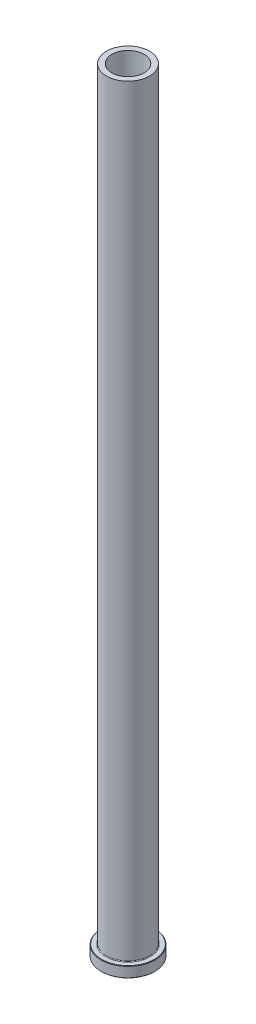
from build123d import *

# Parameters (mm, degrees)
CHAMFER1_SIZE = 0.254


with BuildPart() as part:
    # Sketch1 → Revolve1 (revolve)
    with BuildSketch(Plane.XY, mode=Mode.PRIVATE) as revolve1_sk:
        with BuildLine():
            Line((0, 0), (15.875, 0))
            Line((15.875, 0), (15.875, 6.35))
            Line((15.875, 6.35), (13.154025, 6.35))
            ThreePointArc((13.154025, 6.35), (12.873391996, 6.466241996), (12.75715, 6.746875))
            Line((12.75715, 6.746875), (12.75715, 457.2))
            Line((12.75715, 457.2), (0, 457.2))
            Line((0, 457.2), (0, 0))
        make_face()
    revolve(revolve1_sk.sketch.rotate(Axis((0, 0, 0), (0, 1, 0)), 90), axis=Axis((0, 0, 0), (0, 1, 0)))

    # Sketch2 → Cut-Revolve1 (revolve, cut)
    with BuildSketch(Plane.XY, mode=Mode.PRIVATE) as cut_revolve1_sk:
        Polygon((10.112375, 0), (9.7155, 0.396875), (9.7155, 360.3625), (9.525, 374.65), (9.525, 457.2), (0, 457.2), (0, 0), align=None)
    revolve(cut_revolve1_sk.sketch.rotate(Axis((0, 0, 0), (0, 1, 0)), 90), axis=Axis((0, 0, 0), (0, 1, 0)), mode=Mode.SUBTRACT)

    # Chamfer1
    chamfer1_edges = [part.edges().sort_by_distance(p)[0] for p in [
        (0, 6.35, 15.875),
        (0, 0, 15.875),
    ]]
    chamfer(chamfer1_edges, length=CHAMFER1_SIZE)


solid = part.part
